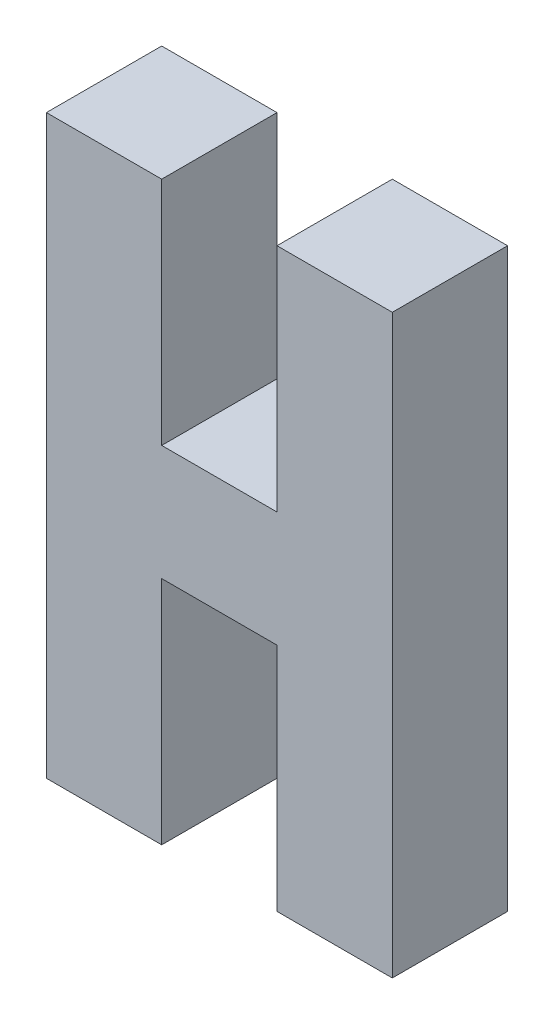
from build123d import *

# Parameters (mm, degrees)
BOSS_EXTRU_1_DEPTH = 10


with BuildPart() as part:
    # Esquisse1 → Boss.-Extru.1 (new body)
    with BuildSketch(Plane.XY):
        Polygon((20, 50), (30, 50), (30, 0), (20, 0), (20, 20), (10, 20), (10, 0), (0, 0), (0, 50), (10, 50), (10, 30), (20, 30), align=None)
    extrude(amount=BOSS_EXTRU_1_DEPTH)


solid = part.part
